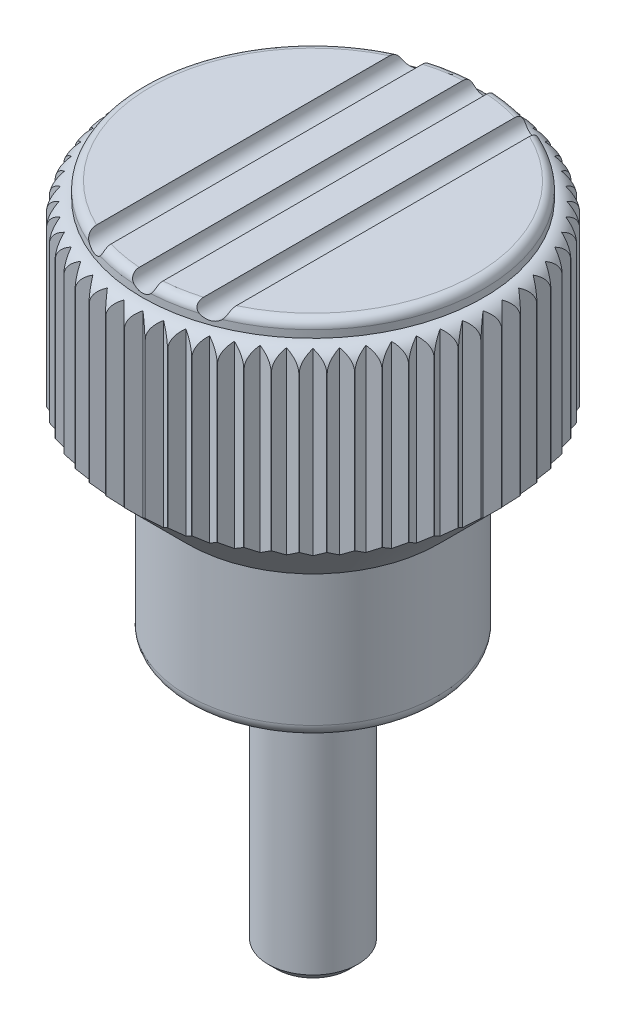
from build123d import *

# Parameters (mm, degrees)
ENL_V_MAT_EXTRU_1_DEPTH      = 22
ENL_V_MAT_EXTRU_1_DEPTH_BACK = 22
ESQUISSE3_W                  = 42
ESQUISSE3_H                  = 42
ENL_V_MAT_EXTRU_2_DEPTH      = 22


with BuildPart() as part:
    # Esquisse1 → R_volution1 (revolve)
    with BuildSketch(Plane.XY, mode=Mode.PRIVATE) as r_volution1_sk:
        with BuildLine():
            Line((0, 22), (9.033333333, 22))
            ThreePointArc((9.033333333, 22), (9.363316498, 21.863316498), (9.5, 21.533333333))
            Line((9.5, 21.533333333), (9.5, 21.12))
            ThreePointArc((9.5, 21.12), (10.207106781, 20.827106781), (10.5, 20.12))
            Line((10.5, 20.12), (10.5, 11.5))
            Line((10.5, 11.5), (7, 8))
            Line((7, 8), (7, 0.7))
            ThreePointArc((7, 0.7), (6.794974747, 0.205025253), (6.3, 0))
            Line((6.3, 0), (0, 0))
            Line((0, 0), (0, 22))
        make_face()
    revolve(r_volution1_sk.sketch.rotate(Axis((0, 0, 0), (0, 1, 0)), 270), axis=Axis((0, 0, 0), (0, 1, 0)))

    # Esquisse2 → Enl_v. mat.-Extru.1 (cut, two sides: drawn at the far end of the back side and taken through both)
    with BuildSketch(Plane.XY.offset(-ENL_V_MAT_EXTRU_1_DEPTH_BACK)):
        with BuildLine():
            Line((-21, 22), (-3.89, 22))
            ThreePointArc((-3.89, 22), (-3.23, 21.34), (-2.57, 22))
            Line((-2.57, 22), (-0.66, 22))
            ThreePointArc((-0.66, 22), (0, 21.34), (0.66, 22))
            Line((0.66, 22), (2.57, 22))
            ThreePointArc((2.57, 22), (3.23, 21.34), (3.89, 22))
            Line((3.89, 22), (21, 22))
            Line((21, 22), (21, 44))
            Line((21, 44), (-21, 44))
            Line((-21, 44), (-21, 22))
        make_face()
    extrude(amount=ENL_V_MAT_EXTRU_1_DEPTH + ENL_V_MAT_EXTRU_1_DEPTH_BACK, mode=Mode.SUBTRACT)

    # Esquisse3 → Enl_v. mat.-Extru.2 (cut)
    with BuildSketch(Plane(origin=(0, 0, 0), x_dir=(-1, 0, 0), z_dir=(0, 1, 0))):
        Rectangle(ESQUISSE3_W, ESQUISSE3_H)
        Polygon((10.51, 0), (9.986295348, 0.523359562), (10.45242512, 1.098594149), (9.876883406, 1.56434465), (10.280331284, 2.18515187), (9.659258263, 2.588190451), (9.995603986, 3.247768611), (9.335804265, 3.583679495), (9.60136276, 4.274802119), (8.910065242, 4.539904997), (9.101926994, 5.255), (8.386705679, 5.44639035), (8.502768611, 6.177623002), (7.771459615, 6.29320391), (7.810452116, 7.032562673), (7.071067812, 7.071067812), (7.032562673, 7.810452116), (6.29320391, 7.771459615), (6.177623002, 8.502768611), (5.44639035, 8.386705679), (5.255, 9.101926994), (4.539904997, 8.910065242), (4.274802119, 9.60136276), (3.583679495, 9.335804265), (3.247768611, 9.995603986), (2.588190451, 9.659258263), (2.18515187, 10.280331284), (1.56434465, 9.876883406), (1.098594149, 10.45242512), (0.523359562, 9.986295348), (0, 10.51), (-0.523359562, 9.986295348), (-1.098594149, 10.45242512), (-1.56434465, 9.876883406), (-2.18515187, 10.280331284), (-2.588190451, 9.659258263), (-3.247768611, 9.995603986), (-3.583679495, 9.335804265), (-4.274802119, 9.60136276), (-4.539904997, 8.910065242), (-5.255, 9.101926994), (-5.44639035, 8.386705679), (-6.177623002, 8.502768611), (-6.29320391, 7.771459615), (-7.032562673, 7.810452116), (-7.071067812, 7.071067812), (-7.810452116, 7.032562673), (-7.771459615, 6.29320391), (-8.502768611, 6.177623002), (-8.386705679, 5.44639035), (-9.101926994, 5.255), (-8.910065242, 4.539904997), (-9.60136276, 4.274802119), (-9.335804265, 3.583679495), (-9.995603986, 3.247768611), (-9.659258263, 2.588190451), (-10.280331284, 2.18515187), (-9.876883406, 1.56434465), (-10.45242512, 1.098594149), (-9.986295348, 0.523359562), (-10.51, 0), (-9.986295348, -0.523359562), (-10.45242512, -1.098594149), (-9.876883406, -1.56434465), (-10.280331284, -2.18515187), (-9.659258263, -2.588190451), (-9.995603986, -3.247768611), (-9.335804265, -3.583679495), (-9.60136276, -4.274802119), (-8.910065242, -4.539904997), (-9.101926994, -5.255), (-8.386705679, -5.44639035), (-8.502768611, -6.177623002), (-7.771459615, -6.29320391), (-7.810452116, -7.032562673), (-7.071067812, -7.071067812), (-7.032562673, -7.810452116), (-6.29320391, -7.771459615), (-6.177623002, -8.502768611), (-5.44639035, -8.386705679), (-5.255, -9.101926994), (-4.539904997, -8.910065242), (-4.274802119, -9.60136276), (-3.583679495, -9.335804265), (-3.247768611, -9.995603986), (-2.588190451, -9.659258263), (-2.18515187, -10.280331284), (-1.56434465, -9.876883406), (-1.098594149, -10.45242512), (-0.523359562, -9.986295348), (0, -10.51), (0.523359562, -9.986295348), (1.098594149, -10.45242512), (1.56434465, -9.876883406), (2.18515187, -10.280331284), (2.588190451, -9.659258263), (3.247768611, -9.995603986), (3.583679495, -9.335804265), (4.274802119, -9.60136276), (4.539904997, -8.910065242), (5.255, -9.101926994), (5.44639035, -8.386705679), (6.177623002, -8.502768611), (6.29320391, -7.771459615), (7.032562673, -7.810452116), (7.071067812, -7.071067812), (7.810452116, -7.032562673), (7.771459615, -6.29320391), (8.502768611, -6.177623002), (8.386705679, -5.44639035), (9.101926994, -5.255), (8.910065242, -4.539904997), (9.60136276, -4.274802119), (9.335804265, -3.583679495), (9.995603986, -3.247768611), (9.659258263, -2.588190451), (10.280331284, -2.18515187), (9.876883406, -1.56434465), (10.45242512, -1.098594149), (9.986295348, -0.523359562), align=None, mode=Mode.SUBTRACT)
    extrude(amount=ENL_V_MAT_EXTRU_2_DEPTH, mode=Mode.SUBTRACT)

    # Esquisse4 → R_volution2 (revolve)
    with BuildSketch(Plane.XY, mode=Mode.PRIVATE) as r_volution2_sk:
        Polygon((0, 4.5), (2.5, 4.5), (2.5, -14.5095), (2.0095, -15), (0, -15), align=None)
    revolve(r_volution2_sk.sketch.rotate(Axis((0, -15, 0), (0, 1, 0)), 270), axis=Axis((0, -15, 0), (0, 1, 0)))


solid = part.part
